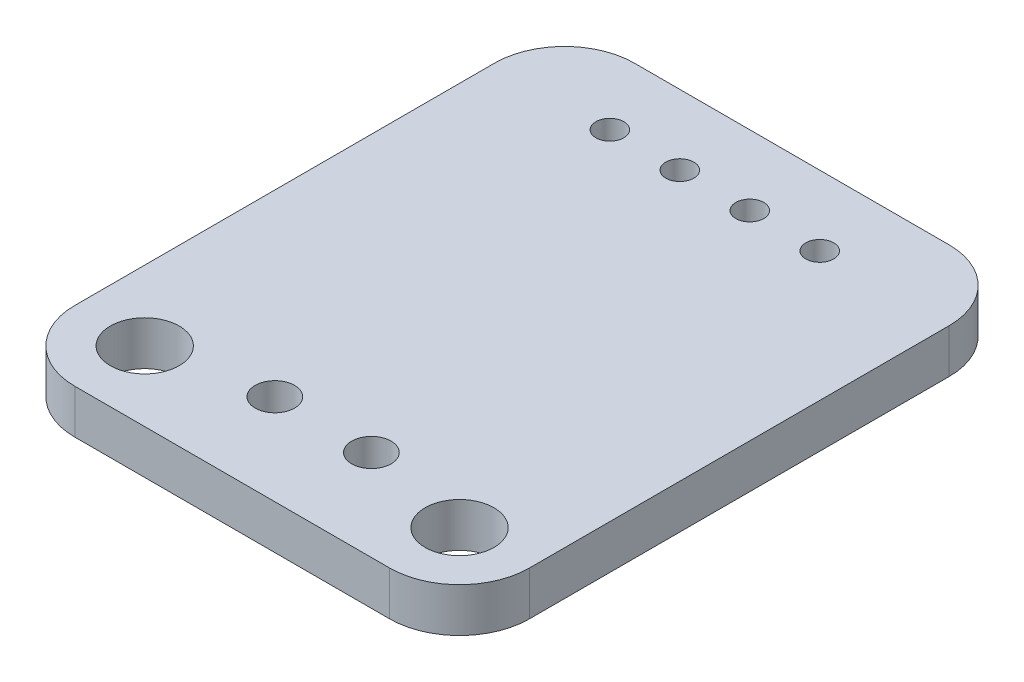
ISO-10303-21;
HEADER;
FILE_DESCRIPTION(('STEP AP214'),'2;1');
FILE_NAME('part.step','',(''),(''),'','','');
FILE_SCHEMA(('AUTOMOTIVE_DESIGN { 1 0 10303 214 1 1 1 1 }'));
ENDSEC;
DATA;
#1=APPLICATION_CONTEXT('core data for automotive mechanical design processes');
#2=APPLICATION_PROTOCOL_DEFINITION('international standard','automotive_design',2000,#1);
#3=PRODUCT_CONTEXT('',#1,'mechanical');
#4=PRODUCT('Part','Part','',(#3));
#5=PRODUCT_RELATED_PRODUCT_CATEGORY('part','',(#4));
#6=PRODUCT_DEFINITION_FORMATION('','',#4);
#7=PRODUCT_DEFINITION_CONTEXT('part definition',#1,'design');
#8=PRODUCT_DEFINITION('design','',#6,#7);
#9=PRODUCT_DEFINITION_SHAPE('','',#8);
#10=(LENGTH_UNIT() NAMED_UNIT(*) SI_UNIT(.MILLI.,.METRE.));
#11=(NAMED_UNIT(*) PLANE_ANGLE_UNIT() SI_UNIT($,.RADIAN.));
#12=(NAMED_UNIT(*) SI_UNIT($,.STERADIAN.) SOLID_ANGLE_UNIT());
#13=UNCERTAINTY_MEASURE_WITH_UNIT(LENGTH_MEASURE(1.E-05),#10,'distance_accuracy_value','');
#14=(GEOMETRIC_REPRESENTATION_CONTEXT(3) GLOBAL_UNCERTAINTY_ASSIGNED_CONTEXT((#13)) GLOBAL_UNIT_ASSIGNED_CONTEXT((#10,
#11,#12)) REPRESENTATION_CONTEXT('',''));
#15=CARTESIAN_POINT('',(0.,0.,0.));
#16=DIRECTION('',(0.,0.,1.));
#17=DIRECTION('',(1.,0.,0.));
#18=AXIS2_PLACEMENT_3D('',#15,#16,#17);
#19=CARTESIAN_POINT('',(-8.255,1.6002,-10.16));
#20=DIRECTION('',(1.,0.,0.));
#21=DIRECTION('',(0.,0.,-1.));
#22=AXIS2_PLACEMENT_3D('',#19,#20,#21);
#23=PLANE('',#22);
#24=DIRECTION('',(0.,0.,1.));
#25=VECTOR('',#24,1.);
#26=CARTESIAN_POINT('',(-8.255,1.6002,-10.16));
#27=LINE('',#26,#25);
#28=CARTESIAN_POINT('',(-8.255,1.6002,-7.62));
#29=VERTEX_POINT('',#28);
#30=CARTESIAN_POINT('',(-8.255,1.6002,7.62));
#31=VERTEX_POINT('',#30);
#32=EDGE_CURVE('E133',#29,#31,#27,.T.);
#33=ORIENTED_EDGE('',*,*,#32,.F.);
#34=DIRECTION('',(0.,-1.,0.));
#35=VECTOR('',#34,1.);
#36=CARTESIAN_POINT('',(-8.255,1.6002,-7.62));
#37=LINE('',#36,#35);
#38=CARTESIAN_POINT('',(-8.255,0.,-7.62));
#39=VERTEX_POINT('',#38);
#40=EDGE_CURVE('E117',#29,#39,#37,.T.);
#41=ORIENTED_EDGE('',*,*,#40,.T.);
#42=DIRECTION('',(0.,0.,1.));
#43=VECTOR('',#42,1.);
#44=CARTESIAN_POINT('',(-8.255,0.,-10.16));
#45=LINE('',#44,#43);
#46=CARTESIAN_POINT('',(-8.255,0.,7.62));
#47=VERTEX_POINT('',#46);
#48=EDGE_CURVE('E130',#39,#47,#45,.T.);
#49=ORIENTED_EDGE('',*,*,#48,.T.);
#50=DIRECTION('',(0.,-1.,0.));
#51=VECTOR('',#50,1.);
#52=CARTESIAN_POINT('',(-8.255,1.6002,7.62));
#53=LINE('',#52,#51);
#54=EDGE_CURVE('E136',#47,#31,#53,.F.);
#55=ORIENTED_EDGE('',*,*,#54,.T.);
#56=EDGE_LOOP('',(#33,#41,#49,#55));
#57=FACE_BOUND('',#56,.T.);
#58=ADVANCED_FACE('F39',(#57),#23,.F.);
#59=CARTESIAN_POINT('',(-8.255,1.6002,10.16));
#60=DIRECTION('',(0.,0.,-1.));
#61=DIRECTION('',(-1.,0.,0.));
#62=AXIS2_PLACEMENT_3D('',#59,#60,#61);
#63=PLANE('',#62);
#64=DIRECTION('',(1.,0.,0.));
#65=VECTOR('',#64,1.);
#66=CARTESIAN_POINT('',(-8.255,0.,10.16));
#67=LINE('',#66,#65);
#68=CARTESIAN_POINT('',(-5.715,0.,10.16));
#69=VERTEX_POINT('',#68);
#70=CARTESIAN_POINT('',(5.715,0.,10.16));
#71=VERTEX_POINT('',#70);
#72=EDGE_CURVE('E141',#69,#71,#67,.T.);
#73=ORIENTED_EDGE('',*,*,#72,.T.);
#74=DIRECTION('',(0.,-1.,0.));
#75=VECTOR('',#74,1.);
#76=CARTESIAN_POINT('',(5.715,1.6002,10.16));
#77=LINE('',#76,#75);
#78=CARTESIAN_POINT('',(5.715,1.6002,10.16));
#79=VERTEX_POINT('',#78);
#80=EDGE_CURVE('E11',#71,#79,#77,.F.);
#81=ORIENTED_EDGE('',*,*,#80,.T.);
#82=DIRECTION('',(1.,0.,0.));
#83=VECTOR('',#82,1.);
#84=CARTESIAN_POINT('',(-8.255,1.6002,10.16));
#85=LINE('',#84,#83);
#86=CARTESIAN_POINT('',(-5.715,1.6002,10.16));
#87=VERTEX_POINT('',#86);
#88=EDGE_CURVE('E191',#87,#79,#85,.T.);
#89=ORIENTED_EDGE('',*,*,#88,.F.);
#90=DIRECTION('',(0.,-1.,0.));
#91=VECTOR('',#90,1.);
#92=CARTESIAN_POINT('',(-5.715,1.6002,10.16));
#93=LINE('',#92,#91);
#94=EDGE_CURVE('E48',#87,#69,#93,.T.);
#95=ORIENTED_EDGE('',*,*,#94,.T.);
#96=EDGE_LOOP('',(#73,#81,#89,#95));
#97=FACE_BOUND('',#96,.T.);
#98=ADVANCED_FACE('F189',(#97),#63,.F.);
#99=CARTESIAN_POINT('',(8.255,1.6002,-10.16));
#100=DIRECTION('',(-1.,0.,0.));
#101=DIRECTION('',(0.,0.,1.));
#102=AXIS2_PLACEMENT_3D('',#99,#100,#101);
#103=PLANE('',#102);
#104=DIRECTION('',(0.,0.,-1.));
#105=VECTOR('',#104,1.);
#106=CARTESIAN_POINT('',(8.255,0.,-10.16));
#107=LINE('',#106,#105);
#108=CARTESIAN_POINT('',(8.255,0.,7.62));
#109=VERTEX_POINT('',#108);
#110=CARTESIAN_POINT('',(8.255,0.,-7.62));
#111=VERTEX_POINT('',#110);
#112=EDGE_CURVE('E148',#109,#111,#107,.T.);
#113=ORIENTED_EDGE('',*,*,#112,.T.);
#114=DIRECTION('',(0.,-1.,0.));
#115=VECTOR('',#114,1.);
#116=CARTESIAN_POINT('',(8.255,1.6002,-7.62));
#117=LINE('',#116,#115);
#118=CARTESIAN_POINT('',(8.255,1.6002,-7.62));
#119=VERTEX_POINT('',#118);
#120=EDGE_CURVE('E55',#111,#119,#117,.F.);
#121=ORIENTED_EDGE('',*,*,#120,.T.);
#122=DIRECTION('',(0.,0.,-1.));
#123=VECTOR('',#122,1.);
#124=CARTESIAN_POINT('',(8.255,1.6002,-10.16));
#125=LINE('',#124,#123);
#126=CARTESIAN_POINT('',(8.255,1.6002,7.62));
#127=VERTEX_POINT('',#126);
#128=EDGE_CURVE('E199',#127,#119,#125,.T.);
#129=ORIENTED_EDGE('',*,*,#128,.F.);
#130=DIRECTION('',(0.,-1.,0.));
#131=VECTOR('',#130,1.);
#132=CARTESIAN_POINT('',(8.255,1.6002,7.62));
#133=LINE('',#132,#131);
#134=EDGE_CURVE('E182',#127,#109,#133,.T.);
#135=ORIENTED_EDGE('',*,*,#134,.T.);
#136=EDGE_LOOP('',(#113,#121,#129,#135));
#137=FACE_BOUND('',#136,.T.);
#138=ADVANCED_FACE('F198',(#137),#103,.F.);
#139=CARTESIAN_POINT('',(-8.255,1.6002,-10.16));
#140=DIRECTION('',(0.,0.,1.));
#141=DIRECTION('',(1.,0.,0.));
#142=AXIS2_PLACEMENT_3D('',#139,#140,#141);
#143=PLANE('',#142);
#144=DIRECTION('',(-1.,0.,0.));
#145=VECTOR('',#144,1.);
#146=CARTESIAN_POINT('',(-8.255,0.,-10.16));
#147=LINE('',#146,#145);
#148=CARTESIAN_POINT('',(5.715,0.,-10.16));
#149=VERTEX_POINT('',#148);
#150=CARTESIAN_POINT('',(-5.715,0.,-10.16));
#151=VERTEX_POINT('',#150);
#152=EDGE_CURVE('E158',#149,#151,#147,.T.);
#153=ORIENTED_EDGE('',*,*,#152,.T.);
#154=DIRECTION('',(0.,-1.,0.));
#155=VECTOR('',#154,1.);
#156=CARTESIAN_POINT('',(-5.715,1.6002,-10.16));
#157=LINE('',#156,#155);
#158=CARTESIAN_POINT('',(-5.715,1.6002,-10.16));
#159=VERTEX_POINT('',#158);
#160=EDGE_CURVE('E118',#151,#159,#157,.F.);
#161=ORIENTED_EDGE('',*,*,#160,.T.);
#162=DIRECTION('',(-1.,0.,0.));
#163=VECTOR('',#162,1.);
#164=CARTESIAN_POINT('',(-8.255,1.6002,-10.16));
#165=LINE('',#164,#163);
#166=CARTESIAN_POINT('',(5.715,1.6002,-10.16));
#167=VERTEX_POINT('',#166);
#168=EDGE_CURVE('E154',#167,#159,#165,.T.);
#169=ORIENTED_EDGE('',*,*,#168,.F.);
#170=DIRECTION('',(0.,-1.,0.));
#171=VECTOR('',#170,1.);
#172=CARTESIAN_POINT('',(5.715,1.6002,-10.16));
#173=LINE('',#172,#171);
#174=EDGE_CURVE('E124',#167,#149,#173,.T.);
#175=ORIENTED_EDGE('',*,*,#174,.T.);
#176=EDGE_LOOP('',(#153,#161,#169,#175));
#177=FACE_BOUND('',#176,.T.);
#178=ADVANCED_FACE('F267',(#177),#143,.F.);
#179=CARTESIAN_POINT('',(0.,1.6002,0.));
#180=DIRECTION('',(0.,1.,0.));
#181=DIRECTION('',(0.,0.,1.));
#182=AXIS2_PLACEMENT_3D('',#179,#180,#181);
#183=PLANE('',#182);
#184=CARTESIAN_POINT('',(1.75260000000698,1.6002,6.858));
#185=DIRECTION('',(0.,1.,0.));
#186=DIRECTION('',(0.,0.,-1.));
#187=AXIS2_PLACEMENT_3D('',#184,#185,#186);
#188=CIRCLE('',#187,0.716091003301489);
#189=CARTESIAN_POINT('',(1.75260000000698,1.6002,7.57409100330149));
#190=VERTEX_POINT('',#189);
#191=EDGE_CURVE('E257',#190,#190,#188,.T.);
#192=ORIENTED_EDGE('',*,*,#191,.F.);
#193=EDGE_LOOP('',(#192));
#194=FACE_BOUND('',#193,.T.);
#195=CARTESIAN_POINT('',(-1.7526,1.6002,6.858));
#196=DIRECTION('',(0.,1.,0.));
#197=DIRECTION('',(0.,0.,1.));
#198=AXIS2_PLACEMENT_3D('',#195,#196,#197);
#199=CIRCLE('',#198,0.716091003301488);
#200=CARTESIAN_POINT('',(-1.7526,1.6002,7.57409100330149));
#201=VERTEX_POINT('',#200);
#202=EDGE_CURVE('E251',#201,#201,#199,.T.);
#203=ORIENTED_EDGE('',*,*,#202,.F.);
#204=EDGE_LOOP('',(#203));
#205=FACE_BOUND('',#204,.T.);
#206=CARTESIAN_POINT('',(3.55398097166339,1.6002,-7.61999999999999));
#207=DIRECTION('',(0.,1.,0.));
#208=DIRECTION('',(0.,0.,1.));
#209=AXIS2_PLACEMENT_3D('',#206,#207,#208);
#210=CIRCLE('',#209,0.508000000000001);
#211=CARTESIAN_POINT('',(3.55398097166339,1.6002,-7.11199999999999));
#212=VERTEX_POINT('',#211);
#213=EDGE_CURVE('E245',#212,#212,#210,.T.);
#214=ORIENTED_EDGE('',*,*,#213,.F.);
#215=EDGE_LOOP('',(#214));
#216=FACE_BOUND('',#215,.T.);
#217=CARTESIAN_POINT('',(1.01398097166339,1.6002,-7.61999999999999));
#218=DIRECTION('',(0.,1.,0.));
#219=DIRECTION('',(0.,0.,1.));
#220=AXIS2_PLACEMENT_3D('',#217,#218,#219);
#221=CIRCLE('',#220,0.508);
#222=CARTESIAN_POINT('',(1.01398097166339,1.6002,-7.11199999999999));
#223=VERTEX_POINT('',#222);
#224=EDGE_CURVE('E238',#223,#223,#221,.T.);
#225=ORIENTED_EDGE('',*,*,#224,.F.);
#226=EDGE_LOOP('',(#225));
#227=FACE_BOUND('',#226,.T.);
#228=CARTESIAN_POINT('',(-1.52601902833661,1.6002,-7.61999999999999));
#229=DIRECTION('',(0.,1.,0.));
#230=DIRECTION('',(0.,0.,1.));
#231=AXIS2_PLACEMENT_3D('',#228,#229,#230);
#232=CIRCLE('',#231,0.508);
#233=CARTESIAN_POINT('',(-1.52601902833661,1.6002,-7.11199999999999));
#234=VERTEX_POINT('',#233);
#235=EDGE_CURVE('E230',#234,#234,#232,.T.);
#236=ORIENTED_EDGE('',*,*,#235,.F.);
#237=EDGE_LOOP('',(#236));
#238=FACE_BOUND('',#237,.T.);
#239=CARTESIAN_POINT('',(-4.06601902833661,1.6002,-7.61999999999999));
#240=DIRECTION('',(0.,1.,0.));
#241=DIRECTION('',(0.,0.,1.));
#242=AXIS2_PLACEMENT_3D('',#239,#240,#241);
#243=CIRCLE('',#242,0.508);
#244=CARTESIAN_POINT('',(-4.06601902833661,1.6002,-7.11199999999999));
#245=VERTEX_POINT('',#244);
#246=EDGE_CURVE('E222',#245,#245,#243,.T.);
#247=ORIENTED_EDGE('',*,*,#246,.F.);
#248=EDGE_LOOP('',(#247));
#249=FACE_BOUND('',#248,.T.);
#250=CARTESIAN_POINT('',(5.715,1.6002,7.62));
#251=DIRECTION('',(0.,1.,0.));
#252=DIRECTION('',(0.,0.,1.));
#253=AXIS2_PLACEMENT_3D('',#250,#251,#252);
#254=CIRCLE('',#253,1.25);
#255=CARTESIAN_POINT('',(5.715,1.6002,8.87));
#256=VERTEX_POINT('',#255);
#257=EDGE_CURVE('E214',#256,#256,#254,.T.);
#258=ORIENTED_EDGE('',*,*,#257,.F.);
#259=EDGE_LOOP('',(#258));
#260=FACE_BOUND('',#259,.T.);
#261=CARTESIAN_POINT('',(-5.715,1.6002,7.62));
#262=DIRECTION('',(0.,1.,0.));
#263=DIRECTION('',(0.,0.,1.));
#264=AXIS2_PLACEMENT_3D('',#261,#262,#263);
#265=CIRCLE('',#264,1.25);
#266=CARTESIAN_POINT('',(-5.715,1.6002,8.87));
#267=VERTEX_POINT('',#266);
#268=EDGE_CURVE('E151',#267,#267,#265,.T.);
#269=ORIENTED_EDGE('',*,*,#268,.F.);
#270=EDGE_LOOP('',(#269));
#271=FACE_BOUND('',#270,.T.);
#272=ORIENTED_EDGE('',*,*,#168,.T.);
#273=CARTESIAN_POINT('',(-5.715,1.6002,-7.62));
#274=DIRECTION('',(0.,1.,0.));
#275=DIRECTION('',(0.,0.,1.));
#276=AXIS2_PLACEMENT_3D('',#273,#274,#275);
#277=CIRCLE('',#276,2.54);
#278=EDGE_CURVE('E179',#159,#29,#277,.T.);
#279=ORIENTED_EDGE('',*,*,#278,.T.);
#280=ORIENTED_EDGE('',*,*,#32,.T.);
#281=CARTESIAN_POINT('',(-5.715,1.6002,7.62));
#282=DIRECTION('',(0.,1.,0.));
#283=DIRECTION('',(0.,0.,1.));
#284=AXIS2_PLACEMENT_3D('',#281,#282,#283);
#285=CIRCLE('',#284,2.54);
#286=EDGE_CURVE('E172',#31,#87,#285,.T.);
#287=ORIENTED_EDGE('',*,*,#286,.T.);
#288=ORIENTED_EDGE('',*,*,#88,.T.);
#289=CARTESIAN_POINT('',(5.715,1.6002,7.62));
#290=DIRECTION('',(0.,1.,0.));
#291=DIRECTION('',(0.,0.,1.));
#292=AXIS2_PLACEMENT_3D('',#289,#290,#291);
#293=CIRCLE('',#292,2.54);
#294=EDGE_CURVE('E62',#79,#127,#293,.T.);
#295=ORIENTED_EDGE('',*,*,#294,.T.);
#296=ORIENTED_EDGE('',*,*,#128,.T.);
#297=CARTESIAN_POINT('',(5.715,1.6002,-7.62));
#298=DIRECTION('',(0.,1.,0.));
#299=DIRECTION('',(0.,0.,1.));
#300=AXIS2_PLACEMENT_3D('',#297,#298,#299);
#301=CIRCLE('',#300,2.54);
#302=EDGE_CURVE('E176',#119,#167,#301,.T.);
#303=ORIENTED_EDGE('',*,*,#302,.T.);
#304=EDGE_LOOP('',(#272,#279,#280,#287,#288,#295,#296,#303));
#305=FACE_BOUND('',#304,.T.);
#306=ADVANCED_FACE('F264',(#194,#205,#216,#227,#238,#249,#260,#271,#305),#183,.T.);
#307=CARTESIAN_POINT('',(0.,0.,0.));
#308=DIRECTION('',(0.,1.,0.));
#309=DIRECTION('',(0.,0.,1.));
#310=AXIS2_PLACEMENT_3D('',#307,#308,#309);
#311=PLANE('',#310);
#312=CARTESIAN_POINT('',(1.75260000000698,0.,6.858));
#313=DIRECTION('',(0.,1.,0.));
#314=DIRECTION('',(0.,0.,1.));
#315=AXIS2_PLACEMENT_3D('',#312,#313,#314);
#316=CIRCLE('',#315,0.716091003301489);
#317=CARTESIAN_POINT('',(1.75260000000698,0.,7.57409100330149));
#318=VERTEX_POINT('',#317);
#319=EDGE_CURVE('E254',#318,#318,#316,.F.);
#320=ORIENTED_EDGE('',*,*,#319,.F.);
#321=EDGE_LOOP('',(#320));
#322=FACE_BOUND('',#321,.T.);
#323=CARTESIAN_POINT('',(-1.7526,0.,6.858));
#324=DIRECTION('',(0.,1.,0.));
#325=DIRECTION('',(0.,0.,1.));
#326=AXIS2_PLACEMENT_3D('',#323,#324,#325);
#327=CIRCLE('',#326,0.716091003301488);
#328=CARTESIAN_POINT('',(-1.7526,0.,7.57409100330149));
#329=VERTEX_POINT('',#328);
#330=EDGE_CURVE('E248',#329,#329,#327,.F.);
#331=ORIENTED_EDGE('',*,*,#330,.F.);
#332=EDGE_LOOP('',(#331));
#333=FACE_BOUND('',#332,.T.);
#334=CARTESIAN_POINT('',(3.55398097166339,0.,-7.61999999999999));
#335=DIRECTION('',(0.,1.,0.));
#336=DIRECTION('',(0.,0.,1.));
#337=AXIS2_PLACEMENT_3D('',#334,#335,#336);
#338=CIRCLE('',#337,0.508000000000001);
#339=CARTESIAN_POINT('',(3.55398097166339,0.,-7.11199999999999));
#340=VERTEX_POINT('',#339);
#341=EDGE_CURVE('E241',#340,#340,#338,.F.);
#342=ORIENTED_EDGE('',*,*,#341,.F.);
#343=EDGE_LOOP('',(#342));
#344=FACE_BOUND('',#343,.T.);
#345=CARTESIAN_POINT('',(1.01398097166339,0.,-7.61999999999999));
#346=DIRECTION('',(0.,1.,0.));
#347=DIRECTION('',(0.,0.,1.));
#348=AXIS2_PLACEMENT_3D('',#345,#346,#347);
#349=CIRCLE('',#348,0.508);
#350=CARTESIAN_POINT('',(1.01398097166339,0.,-7.11199999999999));
#351=VERTEX_POINT('',#350);
#352=EDGE_CURVE('E234',#351,#351,#349,.F.);
#353=ORIENTED_EDGE('',*,*,#352,.F.);
#354=EDGE_LOOP('',(#353));
#355=FACE_BOUND('',#354,.T.);
#356=CARTESIAN_POINT('',(-1.52601902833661,0.,-7.61999999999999));
#357=DIRECTION('',(0.,1.,0.));
#358=DIRECTION('',(0.,0.,1.));
#359=AXIS2_PLACEMENT_3D('',#356,#357,#358);
#360=CIRCLE('',#359,0.508);
#361=CARTESIAN_POINT('',(-1.52601902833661,0.,-7.11199999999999));
#362=VERTEX_POINT('',#361);
#363=EDGE_CURVE('E226',#362,#362,#360,.F.);
#364=ORIENTED_EDGE('',*,*,#363,.F.);
#365=EDGE_LOOP('',(#364));
#366=FACE_BOUND('',#365,.T.);
#367=CARTESIAN_POINT('',(-4.06601902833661,0.,-7.61999999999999));
#368=DIRECTION('',(0.,1.,0.));
#369=DIRECTION('',(0.,0.,1.));
#370=AXIS2_PLACEMENT_3D('',#367,#368,#369);
#371=CIRCLE('',#370,0.508);
#372=CARTESIAN_POINT('',(-4.06601902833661,0.,-7.11199999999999));
#373=VERTEX_POINT('',#372);
#374=EDGE_CURVE('E218',#373,#373,#371,.F.);
#375=ORIENTED_EDGE('',*,*,#374,.F.);
#376=EDGE_LOOP('',(#375));
#377=FACE_BOUND('',#376,.T.);
#378=CARTESIAN_POINT('',(5.715,0.,7.62));
#379=DIRECTION('',(0.,1.,0.));
#380=DIRECTION('',(0.,0.,1.));
#381=AXIS2_PLACEMENT_3D('',#378,#379,#380);
#382=CIRCLE('',#381,1.25);
#383=CARTESIAN_POINT('',(5.715,0.,8.87));
#384=VERTEX_POINT('',#383);
#385=EDGE_CURVE('E210',#384,#384,#382,.F.);
#386=ORIENTED_EDGE('',*,*,#385,.F.);
#387=EDGE_LOOP('',(#386));
#388=FACE_BOUND('',#387,.T.);
#389=CARTESIAN_POINT('',(-5.715,0.,7.62));
#390=DIRECTION('',(0.,1.,0.));
#391=DIRECTION('',(0.,0.,1.));
#392=AXIS2_PLACEMENT_3D('',#389,#390,#391);
#393=CIRCLE('',#392,1.25);
#394=CARTESIAN_POINT('',(-5.715,0.,8.87));
#395=VERTEX_POINT('',#394);
#396=EDGE_CURVE('E142',#395,#395,#393,.F.);
#397=ORIENTED_EDGE('',*,*,#396,.F.);
#398=EDGE_LOOP('',(#397));
#399=FACE_BOUND('',#398,.T.);
#400=ORIENTED_EDGE('',*,*,#48,.F.);
#401=CARTESIAN_POINT('',(-5.715,0.,-7.62));
#402=DIRECTION('',(0.,1.,0.));
#403=DIRECTION('',(0.,0.,1.));
#404=AXIS2_PLACEMENT_3D('',#401,#402,#403);
#405=CIRCLE('',#404,2.54);
#406=EDGE_CURVE('E113',#39,#151,#405,.F.);
#407=ORIENTED_EDGE('',*,*,#406,.T.);
#408=ORIENTED_EDGE('',*,*,#152,.F.);
#409=CARTESIAN_POINT('',(5.715,0.,-7.62));
#410=DIRECTION('',(0.,1.,0.));
#411=DIRECTION('',(0.,0.,1.));
#412=AXIS2_PLACEMENT_3D('',#409,#410,#411);
#413=CIRCLE('',#412,2.54);
#414=EDGE_CURVE('E125',#149,#111,#413,.F.);
#415=ORIENTED_EDGE('',*,*,#414,.T.);
#416=ORIENTED_EDGE('',*,*,#112,.F.);
#417=CARTESIAN_POINT('',(5.715,0.,7.62));
#418=DIRECTION('',(0.,1.,0.));
#419=DIRECTION('',(0.,0.,1.));
#420=AXIS2_PLACEMENT_3D('',#417,#418,#419);
#421=CIRCLE('',#420,2.54);
#422=EDGE_CURVE('E163',#109,#71,#421,.F.);
#423=ORIENTED_EDGE('',*,*,#422,.T.);
#424=ORIENTED_EDGE('',*,*,#72,.F.);
#425=CARTESIAN_POINT('',(-5.715,0.,7.62));
#426=DIRECTION('',(0.,1.,0.));
#427=DIRECTION('',(0.,0.,1.));
#428=AXIS2_PLACEMENT_3D('',#425,#426,#427);
#429=CIRCLE('',#428,2.54);
#430=EDGE_CURVE('E135',#69,#47,#429,.F.);
#431=ORIENTED_EDGE('',*,*,#430,.T.);
#432=EDGE_LOOP('',(#400,#407,#408,#415,#416,#423,#424,#431));
#433=FACE_BOUND('',#432,.T.);
#434=ADVANCED_FACE('F138',(#322,#333,#344,#355,#366,#377,#388,#399,#433),#311,.F.);
#435=CARTESIAN_POINT('',(-5.715,-0.000999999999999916,7.62));
#436=DIRECTION('',(0.,1.,0.));
#437=DIRECTION('',(0.,0.,1.));
#438=AXIS2_PLACEMENT_3D('',#435,#436,#437);
#439=CYLINDRICAL_SURFACE('',#438,1.25);
#440=CARTESIAN_POINT('',(-5.715,1.6002,8.87));
#441=CARTESIAN_POINT('',(-5.715,1.58353125,8.87));
#442=CARTESIAN_POINT('',(-5.715,1.5668625,8.87));
#443=CARTESIAN_POINT('',(-5.715,1.533525,8.87));
#444=CARTESIAN_POINT('',(-5.715,1.51685625,8.87));
#445=CARTESIAN_POINT('',(-5.715,1.48351875,8.87));
#446=CARTESIAN_POINT('',(-5.715,1.46685,8.87));
#447=CARTESIAN_POINT('',(-5.715,1.4335125,8.87));
#448=CARTESIAN_POINT('',(-5.715,1.41684375,8.87));
#449=CARTESIAN_POINT('',(-5.715,1.38350625,8.87));
#450=CARTESIAN_POINT('',(-5.715,1.3668375,8.87));
#451=CARTESIAN_POINT('',(-5.715,1.3335,8.87));
#452=CARTESIAN_POINT('',(-5.715,1.31683125,8.87));
#453=CARTESIAN_POINT('',(-5.715,1.28349375,8.87));
#454=CARTESIAN_POINT('',(-5.715,1.266825,8.87));
#455=CARTESIAN_POINT('',(-5.715,1.2334875,8.87));
#456=CARTESIAN_POINT('',(-5.715,1.21681875,8.87));
#457=CARTESIAN_POINT('',(-5.715,1.18348125,8.87));
#458=CARTESIAN_POINT('',(-5.715,1.1668125,8.87));
#459=CARTESIAN_POINT('',(-5.715,1.133475,8.87));
#460=CARTESIAN_POINT('',(-5.715,1.11680625,8.87));
#461=CARTESIAN_POINT('',(-5.715,1.08346875,8.87));
#462=CARTESIAN_POINT('',(-5.715,1.0668,8.87));
#463=CARTESIAN_POINT('',(-5.715,1.0334625,8.87));
#464=CARTESIAN_POINT('',(-5.715,1.01679375,8.87));
#465=CARTESIAN_POINT('',(-5.715,0.98345625,8.87));
#466=CARTESIAN_POINT('',(-5.715,0.9667875,8.87));
#467=CARTESIAN_POINT('',(-5.715,0.93345,8.87));
#468=CARTESIAN_POINT('',(-5.715,0.91678125,8.87));
#469=CARTESIAN_POINT('',(-5.715,0.88344375,8.87));
#470=CARTESIAN_POINT('',(-5.715,0.866775,8.87));
#471=CARTESIAN_POINT('',(-5.715,0.8334375,8.87));
#472=CARTESIAN_POINT('',(-5.715,0.81676875,8.87));
#473=CARTESIAN_POINT('',(-5.715,0.78343125,8.87));
#474=CARTESIAN_POINT('',(-5.715,0.7667625,8.87));
#475=CARTESIAN_POINT('',(-5.715,0.733425,8.87));
#476=CARTESIAN_POINT('',(-5.715,0.71675625,8.87));
#477=CARTESIAN_POINT('',(-5.715,0.68341875,8.87));
#478=CARTESIAN_POINT('',(-5.715,0.66675,8.87));
#479=CARTESIAN_POINT('',(-5.715,0.6334125,8.87));
#480=CARTESIAN_POINT('',(-5.715,0.61674375,8.87));
#481=CARTESIAN_POINT('',(-5.715,0.58340625,8.87));
#482=CARTESIAN_POINT('',(-5.715,0.5667375,8.87));
#483=CARTESIAN_POINT('',(-5.715,0.5334,8.87));
#484=CARTESIAN_POINT('',(-5.715,0.51673125,8.87));
#485=CARTESIAN_POINT('',(-5.715,0.48339375,8.87));
#486=CARTESIAN_POINT('',(-5.715,0.466725,8.87));
#487=CARTESIAN_POINT('',(-5.715,0.4333875,8.87));
#488=CARTESIAN_POINT('',(-5.715,0.41671875,8.87));
#489=CARTESIAN_POINT('',(-5.715,0.38338125,8.87));
#490=CARTESIAN_POINT('',(-5.715,0.3667125,8.87));
#491=CARTESIAN_POINT('',(-5.715,0.333375,8.87));
#492=CARTESIAN_POINT('',(-5.715,0.31670625,8.87));
#493=CARTESIAN_POINT('',(-5.715,0.28336875,8.87));
#494=CARTESIAN_POINT('',(-5.715,0.2667,8.87));
#495=CARTESIAN_POINT('',(-5.715,0.2333625,8.87));
#496=CARTESIAN_POINT('',(-5.715,0.21669375,8.87));
#497=CARTESIAN_POINT('',(-5.715,0.18335625,8.87));
#498=CARTESIAN_POINT('',(-5.715,0.1666875,8.87));
#499=CARTESIAN_POINT('',(-5.715,0.13335,8.87));
#500=CARTESIAN_POINT('',(-5.715,0.11668125,8.87));
#501=CARTESIAN_POINT('',(-5.715,0.08334375,8.87));
#502=CARTESIAN_POINT('',(-5.715,0.066675,8.87));
#503=CARTESIAN_POINT('',(-5.715,0.0333375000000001,8.87));
#504=CARTESIAN_POINT('',(-5.715,0.01666875,8.87));
#505=CARTESIAN_POINT('',(-5.715,0.,8.87));
#506=B_SPLINE_CURVE_WITH_KNOTS('',3,(#440,#441,#442,#443,#444,#445,#446,#447,#448,#449,#450,
#451,#452,#453,#454,#455,#456,#457,#458,#459,#460,#461,#462,#463,#464,#465,#466,#467,#468,#469,
#470,#471,#472,#473,#474,#475,#476,#477,#478,#479,#480,#481,#482,#483,#484,#485,#486,#487,#488,
#489,#490,#491,#492,#493,#494,#495,#496,#497,#498,#499,#500,#501,#502,#503,#504,#505),
.UNSPECIFIED.,.F.,.F.,(4,2,2,2,2,2,2,2,2,2,2,2,2,2,2,2,2,2,2,2,2,2,2,2,2,2,2,2,2,2,2,2,4),(0.,
0.0500062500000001,0.1000125,0.15001875,0.200025,0.25003125,0.3000375,0.35004375,0.40005,
0.45005625,0.5000625,0.55006875,0.600075,0.65008125,0.7000875,0.75009375,0.8001,0.85010625,
0.9001125,0.95011875,1.000125,1.05013125,1.1001375,1.15014375,1.20015,1.25015625,1.3001625,
1.35016875,1.400175,1.45018125,1.5001875,1.55019375,1.6002),.UNSPECIFIED.);
#507=EDGE_CURVE('BSEAM307',#267,#395,#506,.T.);
#508=ORIENTED_EDGE('',*,*,#268,.T.);
#509=ORIENTED_EDGE('',*,*,#396,.T.);
#510=ORIENTED_EDGE('',*,*,#507,.T.);
#511=ORIENTED_EDGE('',*,*,#507,.F.);
#512=EDGE_LOOP('',(#508,#510,#509,#511));
#513=FACE_BOUND('',#512,.T.);
#514=ADVANCED_FACE('F307',(#513),#439,.F.);
#515=CARTESIAN_POINT('',(5.715,-0.000999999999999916,7.62));
#516=DIRECTION('',(0.,1.,0.));
#517=DIRECTION('',(0.,0.,1.));
#518=AXIS2_PLACEMENT_3D('',#515,#516,#517);
#519=CYLINDRICAL_SURFACE('',#518,1.25);
#520=CARTESIAN_POINT('',(5.715,1.6002,8.87));
#521=CARTESIAN_POINT('',(5.715,1.58353125,8.87));
#522=CARTESIAN_POINT('',(5.715,1.5668625,8.87));
#523=CARTESIAN_POINT('',(5.715,1.533525,8.87));
#524=CARTESIAN_POINT('',(5.715,1.51685625,8.87));
#525=CARTESIAN_POINT('',(5.715,1.48351875,8.87));
#526=CARTESIAN_POINT('',(5.715,1.46685,8.87));
#527=CARTESIAN_POINT('',(5.715,1.4335125,8.87));
#528=CARTESIAN_POINT('',(5.715,1.41684375,8.87));
#529=CARTESIAN_POINT('',(5.715,1.38350625,8.87));
#530=CARTESIAN_POINT('',(5.715,1.3668375,8.87));
#531=CARTESIAN_POINT('',(5.715,1.3335,8.87));
#532=CARTESIAN_POINT('',(5.715,1.31683125,8.87));
#533=CARTESIAN_POINT('',(5.715,1.28349375,8.87));
#534=CARTESIAN_POINT('',(5.715,1.266825,8.87));
#535=CARTESIAN_POINT('',(5.715,1.2334875,8.87));
#536=CARTESIAN_POINT('',(5.715,1.21681875,8.87));
#537=CARTESIAN_POINT('',(5.715,1.18348125,8.87));
#538=CARTESIAN_POINT('',(5.715,1.1668125,8.87));
#539=CARTESIAN_POINT('',(5.715,1.133475,8.87));
#540=CARTESIAN_POINT('',(5.715,1.11680625,8.87));
#541=CARTESIAN_POINT('',(5.715,1.08346875,8.87));
#542=CARTESIAN_POINT('',(5.715,1.0668,8.87));
#543=CARTESIAN_POINT('',(5.715,1.0334625,8.87));
#544=CARTESIAN_POINT('',(5.715,1.01679375,8.87));
#545=CARTESIAN_POINT('',(5.715,0.98345625,8.87));
#546=CARTESIAN_POINT('',(5.715,0.9667875,8.87));
#547=CARTESIAN_POINT('',(5.715,0.93345,8.87));
#548=CARTESIAN_POINT('',(5.715,0.91678125,8.87));
#549=CARTESIAN_POINT('',(5.715,0.88344375,8.87));
#550=CARTESIAN_POINT('',(5.715,0.866775,8.87));
#551=CARTESIAN_POINT('',(5.715,0.8334375,8.87));
#552=CARTESIAN_POINT('',(5.715,0.81676875,8.87));
#553=CARTESIAN_POINT('',(5.715,0.78343125,8.87));
#554=CARTESIAN_POINT('',(5.715,0.7667625,8.87));
#555=CARTESIAN_POINT('',(5.715,0.733425,8.87));
#556=CARTESIAN_POINT('',(5.715,0.71675625,8.87));
#557=CARTESIAN_POINT('',(5.715,0.68341875,8.87));
#558=CARTESIAN_POINT('',(5.715,0.66675,8.87));
#559=CARTESIAN_POINT('',(5.715,0.6334125,8.87));
#560=CARTESIAN_POINT('',(5.715,0.61674375,8.87));
#561=CARTESIAN_POINT('',(5.715,0.58340625,8.87));
#562=CARTESIAN_POINT('',(5.715,0.5667375,8.87));
#563=CARTESIAN_POINT('',(5.715,0.5334,8.87));
#564=CARTESIAN_POINT('',(5.715,0.51673125,8.87));
#565=CARTESIAN_POINT('',(5.715,0.48339375,8.87));
#566=CARTESIAN_POINT('',(5.715,0.466725,8.87));
#567=CARTESIAN_POINT('',(5.715,0.4333875,8.87));
#568=CARTESIAN_POINT('',(5.715,0.41671875,8.87));
#569=CARTESIAN_POINT('',(5.715,0.38338125,8.87));
#570=CARTESIAN_POINT('',(5.715,0.3667125,8.87));
#571=CARTESIAN_POINT('',(5.715,0.333375,8.87));
#572=CARTESIAN_POINT('',(5.715,0.31670625,8.87));
#573=CARTESIAN_POINT('',(5.715,0.28336875,8.87));
#574=CARTESIAN_POINT('',(5.715,0.2667,8.87));
#575=CARTESIAN_POINT('',(5.715,0.2333625,8.87));
#576=CARTESIAN_POINT('',(5.715,0.21669375,8.87));
#577=CARTESIAN_POINT('',(5.715,0.18335625,8.87));
#578=CARTESIAN_POINT('',(5.715,0.1666875,8.87));
#579=CARTESIAN_POINT('',(5.715,0.13335,8.87));
#580=CARTESIAN_POINT('',(5.715,0.11668125,8.87));
#581=CARTESIAN_POINT('',(5.715,0.08334375,8.87));
#582=CARTESIAN_POINT('',(5.715,0.066675,8.87));
#583=CARTESIAN_POINT('',(5.715,0.0333375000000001,8.87));
#584=CARTESIAN_POINT('',(5.715,0.01666875,8.87));
#585=CARTESIAN_POINT('',(5.715,0.,8.87));
#586=B_SPLINE_CURVE_WITH_KNOTS('',3,(#520,#521,#522,#523,#524,#525,#526,#527,#528,#529,#530,
#531,#532,#533,#534,#535,#536,#537,#538,#539,#540,#541,#542,#543,#544,#545,#546,#547,#548,#549,
#550,#551,#552,#553,#554,#555,#556,#557,#558,#559,#560,#561,#562,#563,#564,#565,#566,#567,#568,
#569,#570,#571,#572,#573,#574,#575,#576,#577,#578,#579,#580,#581,#582,#583,#584,#585),
.UNSPECIFIED.,.F.,.F.,(4,2,2,2,2,2,2,2,2,2,2,2,2,2,2,2,2,2,2,2,2,2,2,2,2,2,2,2,2,2,2,2,4),(0.,
0.0500062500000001,0.1000125,0.15001875,0.200025,0.25003125,0.3000375,0.35004375,0.40005,
0.45005625,0.5000625,0.55006875,0.600075,0.65008125,0.7000875,0.75009375,0.8001,0.85010625,
0.9001125,0.95011875,1.000125,1.05013125,1.1001375,1.15014375,1.20015,1.25015625,1.3001625,
1.35016875,1.400175,1.45018125,1.5001875,1.55019375,1.6002),.UNSPECIFIED.);
#587=EDGE_CURVE('BSEAM312',#256,#384,#586,.T.);
#588=ORIENTED_EDGE('',*,*,#257,.T.);
#589=ORIENTED_EDGE('',*,*,#385,.T.);
#590=ORIENTED_EDGE('',*,*,#587,.T.);
#591=ORIENTED_EDGE('',*,*,#587,.F.);
#592=EDGE_LOOP('',(#588,#590,#589,#591));
#593=FACE_BOUND('',#592,.T.);
#594=ADVANCED_FACE('F312',(#593),#519,.F.);
#595=CARTESIAN_POINT('',(-4.06601902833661,-0.000999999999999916,-7.61999999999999));
#596=DIRECTION('',(0.,1.,0.));
#597=DIRECTION('',(0.,0.,1.));
#598=AXIS2_PLACEMENT_3D('',#595,#596,#597);
#599=CYLINDRICAL_SURFACE('',#598,0.508);
#600=ORIENTED_EDGE('',*,*,#246,.T.);
#601=EDGE_LOOP('',(#600));
#602=FACE_BOUND('',#601,.T.);
#603=ORIENTED_EDGE('',*,*,#374,.T.);
#604=EDGE_LOOP('',(#603));
#605=FACE_BOUND('',#604,.T.);
#606=ADVANCED_FACE('F316',(#602,#605),#599,.F.);
#607=CARTESIAN_POINT('',(-1.52601902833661,-0.000999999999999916,-7.61999999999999));
#608=DIRECTION('',(0.,1.,0.));
#609=DIRECTION('',(0.,0.,1.));
#610=AXIS2_PLACEMENT_3D('',#607,#608,#609);
#611=CYLINDRICAL_SURFACE('',#610,0.508);
#612=ORIENTED_EDGE('',*,*,#235,.T.);
#613=EDGE_LOOP('',(#612));
#614=FACE_BOUND('',#613,.T.);
#615=ORIENTED_EDGE('',*,*,#363,.T.);
#616=EDGE_LOOP('',(#615));
#617=FACE_BOUND('',#616,.T.);
#618=ADVANCED_FACE('F320',(#614,#617),#611,.F.);
#619=CARTESIAN_POINT('',(1.01398097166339,-0.000999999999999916,-7.61999999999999));
#620=DIRECTION('',(0.,1.,0.));
#621=DIRECTION('',(0.,0.,1.));
#622=AXIS2_PLACEMENT_3D('',#619,#620,#621);
#623=CYLINDRICAL_SURFACE('',#622,0.508);
#624=ORIENTED_EDGE('',*,*,#224,.T.);
#625=EDGE_LOOP('',(#624));
#626=FACE_BOUND('',#625,.T.);
#627=ORIENTED_EDGE('',*,*,#352,.T.);
#628=EDGE_LOOP('',(#627));
#629=FACE_BOUND('',#628,.T.);
#630=ADVANCED_FACE('F324',(#626,#629),#623,.F.);
#631=CARTESIAN_POINT('',(3.55398097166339,-0.000999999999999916,-7.61999999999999));
#632=DIRECTION('',(0.,1.,0.));
#633=DIRECTION('',(0.,0.,1.));
#634=AXIS2_PLACEMENT_3D('',#631,#632,#633);
#635=CYLINDRICAL_SURFACE('',#634,0.508000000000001);
#636=ORIENTED_EDGE('',*,*,#213,.T.);
#637=EDGE_LOOP('',(#636));
#638=FACE_BOUND('',#637,.T.);
#639=ORIENTED_EDGE('',*,*,#341,.T.);
#640=EDGE_LOOP('',(#639));
#641=FACE_BOUND('',#640,.T.);
#642=ADVANCED_FACE('F293',(#638,#641),#635,.F.);
#643=CARTESIAN_POINT('',(-5.715,1.6002,-7.62));
#644=DIRECTION('',(0.,-1.,0.));
#645=DIRECTION('',(0.,0.,-1.));
#646=AXIS2_PLACEMENT_3D('',#643,#644,#645);
#647=CYLINDRICAL_SURFACE('',#646,2.54);
#648=ORIENTED_EDGE('',*,*,#278,.F.);
#649=ORIENTED_EDGE('',*,*,#160,.F.);
#650=ORIENTED_EDGE('',*,*,#406,.F.);
#651=ORIENTED_EDGE('',*,*,#40,.F.);
#652=EDGE_LOOP('',(#648,#649,#650,#651));
#653=FACE_BOUND('',#652,.T.);
#654=ADVANCED_FACE('F116',(#653),#647,.T.);
#655=CARTESIAN_POINT('',(5.715,1.6002,-7.62));
#656=DIRECTION('',(0.,-1.,0.));
#657=DIRECTION('',(0.,0.,-1.));
#658=AXIS2_PLACEMENT_3D('',#655,#656,#657);
#659=CYLINDRICAL_SURFACE('',#658,2.54);
#660=ORIENTED_EDGE('',*,*,#302,.F.);
#661=ORIENTED_EDGE('',*,*,#120,.F.);
#662=ORIENTED_EDGE('',*,*,#414,.F.);
#663=ORIENTED_EDGE('',*,*,#174,.F.);
#664=EDGE_LOOP('',(#660,#661,#662,#663));
#665=FACE_BOUND('',#664,.T.);
#666=ADVANCED_FACE('F286',(#665),#659,.T.);
#667=CARTESIAN_POINT('',(5.715,1.6002,7.62));
#668=DIRECTION('',(0.,-1.,0.));
#669=DIRECTION('',(0.,0.,-1.));
#670=AXIS2_PLACEMENT_3D('',#667,#668,#669);
#671=CYLINDRICAL_SURFACE('',#670,2.54);
#672=ORIENTED_EDGE('',*,*,#294,.F.);
#673=ORIENTED_EDGE('',*,*,#80,.F.);
#674=ORIENTED_EDGE('',*,*,#422,.F.);
#675=ORIENTED_EDGE('',*,*,#134,.F.);
#676=EDGE_LOOP('',(#672,#673,#674,#675));
#677=FACE_BOUND('',#676,.T.);
#678=ADVANCED_FACE('F197',(#677),#671,.T.);
#679=CARTESIAN_POINT('',(-5.715,1.6002,7.62));
#680=DIRECTION('',(0.,-1.,0.));
#681=DIRECTION('',(0.,0.,-1.));
#682=AXIS2_PLACEMENT_3D('',#679,#680,#681);
#683=CYLINDRICAL_SURFACE('',#682,2.54);
#684=ORIENTED_EDGE('',*,*,#286,.F.);
#685=ORIENTED_EDGE('',*,*,#54,.F.);
#686=ORIENTED_EDGE('',*,*,#430,.F.);
#687=ORIENTED_EDGE('',*,*,#94,.F.);
#688=EDGE_LOOP('',(#684,#685,#686,#687));
#689=FACE_BOUND('',#688,.T.);
#690=ADVANCED_FACE('F41',(#689),#683,.T.);
#691=CARTESIAN_POINT('',(-1.7526,-0.000999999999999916,6.858));
#692=DIRECTION('',(0.,1.,0.));
#693=DIRECTION('',(0.,0.,1.));
#694=AXIS2_PLACEMENT_3D('',#691,#692,#693);
#695=CYLINDRICAL_SURFACE('',#694,0.716091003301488);
#696=CARTESIAN_POINT('',(-1.7526,1.6002,7.57409100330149));
#697=CARTESIAN_POINT('',(-1.7526,1.58353125,7.57409100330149));
#698=CARTESIAN_POINT('',(-1.7526,1.5668625,7.57409100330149));
#699=CARTESIAN_POINT('',(-1.7526,1.533525,7.57409100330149));
#700=CARTESIAN_POINT('',(-1.7526,1.51685625,7.57409100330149));
#701=CARTESIAN_POINT('',(-1.7526,1.48351875,7.57409100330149));
#702=CARTESIAN_POINT('',(-1.7526,1.46685,7.57409100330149));
#703=CARTESIAN_POINT('',(-1.7526,1.4335125,7.57409100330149));
#704=CARTESIAN_POINT('',(-1.7526,1.41684375,7.57409100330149));
#705=CARTESIAN_POINT('',(-1.7526,1.38350625,7.57409100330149));
#706=CARTESIAN_POINT('',(-1.7526,1.3668375,7.57409100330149));
#707=CARTESIAN_POINT('',(-1.7526,1.3335,7.57409100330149));
#708=CARTESIAN_POINT('',(-1.7526,1.31683125,7.57409100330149));
#709=CARTESIAN_POINT('',(-1.7526,1.28349375,7.57409100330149));
#710=CARTESIAN_POINT('',(-1.7526,1.266825,7.57409100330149));
#711=CARTESIAN_POINT('',(-1.7526,1.2334875,7.57409100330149));
#712=CARTESIAN_POINT('',(-1.7526,1.21681875,7.57409100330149));
#713=CARTESIAN_POINT('',(-1.7526,1.18348125,7.57409100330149));
#714=CARTESIAN_POINT('',(-1.7526,1.1668125,7.57409100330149));
#715=CARTESIAN_POINT('',(-1.7526,1.133475,7.57409100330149));
#716=CARTESIAN_POINT('',(-1.7526,1.11680625,7.57409100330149));
#717=CARTESIAN_POINT('',(-1.7526,1.08346875,7.57409100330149));
#718=CARTESIAN_POINT('',(-1.7526,1.0668,7.57409100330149));
#719=CARTESIAN_POINT('',(-1.7526,1.0334625,7.57409100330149));
#720=CARTESIAN_POINT('',(-1.7526,1.01679375,7.57409100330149));
#721=CARTESIAN_POINT('',(-1.7526,0.98345625,7.57409100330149));
#722=CARTESIAN_POINT('',(-1.7526,0.9667875,7.57409100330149));
#723=CARTESIAN_POINT('',(-1.7526,0.93345,7.57409100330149));
#724=CARTESIAN_POINT('',(-1.7526,0.91678125,7.57409100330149));
#725=CARTESIAN_POINT('',(-1.7526,0.88344375,7.57409100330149));
#726=CARTESIAN_POINT('',(-1.7526,0.866775,7.57409100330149));
#727=CARTESIAN_POINT('',(-1.7526,0.8334375,7.57409100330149));
#728=CARTESIAN_POINT('',(-1.7526,0.81676875,7.57409100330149));
#729=CARTESIAN_POINT('',(-1.7526,0.78343125,7.57409100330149));
#730=CARTESIAN_POINT('',(-1.7526,0.7667625,7.57409100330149));
#731=CARTESIAN_POINT('',(-1.7526,0.733425,7.57409100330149));
#732=CARTESIAN_POINT('',(-1.7526,0.71675625,7.57409100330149));
#733=CARTESIAN_POINT('',(-1.7526,0.68341875,7.57409100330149));
#734=CARTESIAN_POINT('',(-1.7526,0.66675,7.57409100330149));
#735=CARTESIAN_POINT('',(-1.7526,0.6334125,7.57409100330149));
#736=CARTESIAN_POINT('',(-1.7526,0.61674375,7.57409100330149));
#737=CARTESIAN_POINT('',(-1.7526,0.58340625,7.57409100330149));
#738=CARTESIAN_POINT('',(-1.7526,0.5667375,7.57409100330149));
#739=CARTESIAN_POINT('',(-1.7526,0.5334,7.57409100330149));
#740=CARTESIAN_POINT('',(-1.7526,0.51673125,7.57409100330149));
#741=CARTESIAN_POINT('',(-1.7526,0.48339375,7.57409100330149));
#742=CARTESIAN_POINT('',(-1.7526,0.466725,7.57409100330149));
#743=CARTESIAN_POINT('',(-1.7526,0.4333875,7.57409100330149));
#744=CARTESIAN_POINT('',(-1.7526,0.41671875,7.57409100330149));
#745=CARTESIAN_POINT('',(-1.7526,0.38338125,7.57409100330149));
#746=CARTESIAN_POINT('',(-1.7526,0.3667125,7.57409100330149));
#747=CARTESIAN_POINT('',(-1.7526,0.333375,7.57409100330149));
#748=CARTESIAN_POINT('',(-1.7526,0.31670625,7.57409100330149));
#749=CARTESIAN_POINT('',(-1.7526,0.28336875,7.57409100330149));
#750=CARTESIAN_POINT('',(-1.7526,0.2667,7.57409100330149));
#751=CARTESIAN_POINT('',(-1.7526,0.2333625,7.57409100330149));
#752=CARTESIAN_POINT('',(-1.7526,0.21669375,7.57409100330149));
#753=CARTESIAN_POINT('',(-1.7526,0.18335625,7.57409100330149));
#754=CARTESIAN_POINT('',(-1.7526,0.1666875,7.57409100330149));
#755=CARTESIAN_POINT('',(-1.7526,0.13335,7.57409100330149));
#756=CARTESIAN_POINT('',(-1.7526,0.11668125,7.57409100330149));
#757=CARTESIAN_POINT('',(-1.7526,0.08334375,7.57409100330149));
#758=CARTESIAN_POINT('',(-1.7526,0.066675,7.57409100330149));
#759=CARTESIAN_POINT('',(-1.7526,0.0333375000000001,7.57409100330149));
#760=CARTESIAN_POINT('',(-1.7526,0.01666875,7.57409100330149));
#761=CARTESIAN_POINT('',(-1.7526,0.,7.57409100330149));
#762=B_SPLINE_CURVE_WITH_KNOTS('',3,(#696,#697,#698,#699,#700,#701,#702,#703,#704,#705,#706,
#707,#708,#709,#710,#711,#712,#713,#714,#715,#716,#717,#718,#719,#720,#721,#722,#723,#724,#725,
#726,#727,#728,#729,#730,#731,#732,#733,#734,#735,#736,#737,#738,#739,#740,#741,#742,#743,#744,
#745,#746,#747,#748,#749,#750,#751,#752,#753,#754,#755,#756,#757,#758,#759,#760,#761),
.UNSPECIFIED.,.F.,.F.,(4,2,2,2,2,2,2,2,2,2,2,2,2,2,2,2,2,2,2,2,2,2,2,2,2,2,2,2,2,2,2,2,4),(0.,
0.0500062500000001,0.1000125,0.15001875,0.200025,0.25003125,0.3000375,0.35004375,0.40005,
0.45005625,0.5000625,0.55006875,0.600075,0.65008125,0.7000875,0.75009375,0.8001,0.85010625,
0.9001125,0.95011875,1.000125,1.05013125,1.1001375,1.15014375,1.20015,1.25015625,1.3001625,
1.35016875,1.400175,1.45018125,1.5001875,1.55019375,1.6002),.UNSPECIFIED.);
#763=EDGE_CURVE('BSEAM332',#201,#329,#762,.T.);
#764=ORIENTED_EDGE('',*,*,#202,.T.);
#765=ORIENTED_EDGE('',*,*,#330,.T.);
#766=ORIENTED_EDGE('',*,*,#763,.T.);
#767=ORIENTED_EDGE('',*,*,#763,.F.);
#768=EDGE_LOOP('',(#764,#766,#765,#767));
#769=FACE_BOUND('',#768,.T.);
#770=ADVANCED_FACE('F332',(#769),#695,.F.);
#771=CARTESIAN_POINT('',(1.75260000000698,-0.000999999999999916,6.858));
#772=DIRECTION('',(0.,1.,0.));
#773=DIRECTION('',(0.,0.,1.));
#774=AXIS2_PLACEMENT_3D('',#771,#772,#773);
#775=CYLINDRICAL_SURFACE('',#774,0.716091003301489);
#776=CARTESIAN_POINT('',(1.75260000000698,1.6002,7.57409100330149));
#777=CARTESIAN_POINT('',(1.75260000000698,1.58353125,7.57409100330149));
#778=CARTESIAN_POINT('',(1.75260000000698,1.5668625,7.57409100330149));
#779=CARTESIAN_POINT('',(1.75260000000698,1.533525,7.57409100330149));
#780=CARTESIAN_POINT('',(1.75260000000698,1.51685625,7.57409100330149));
#781=CARTESIAN_POINT('',(1.75260000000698,1.48351875,7.57409100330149));
#782=CARTESIAN_POINT('',(1.75260000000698,1.46685,7.57409100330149));
#783=CARTESIAN_POINT('',(1.75260000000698,1.4335125,7.57409100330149));
#784=CARTESIAN_POINT('',(1.75260000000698,1.41684375,7.57409100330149));
#785=CARTESIAN_POINT('',(1.75260000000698,1.38350625,7.57409100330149));
#786=CARTESIAN_POINT('',(1.75260000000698,1.3668375,7.57409100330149));
#787=CARTESIAN_POINT('',(1.75260000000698,1.3335,7.57409100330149));
#788=CARTESIAN_POINT('',(1.75260000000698,1.31683125,7.57409100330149));
#789=CARTESIAN_POINT('',(1.75260000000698,1.28349375,7.57409100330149));
#790=CARTESIAN_POINT('',(1.75260000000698,1.266825,7.57409100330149));
#791=CARTESIAN_POINT('',(1.75260000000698,1.2334875,7.57409100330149));
#792=CARTESIAN_POINT('',(1.75260000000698,1.21681875,7.57409100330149));
#793=CARTESIAN_POINT('',(1.75260000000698,1.18348125,7.57409100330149));
#794=CARTESIAN_POINT('',(1.75260000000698,1.1668125,7.57409100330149));
#795=CARTESIAN_POINT('',(1.75260000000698,1.133475,7.57409100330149));
#796=CARTESIAN_POINT('',(1.75260000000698,1.11680625,7.57409100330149));
#797=CARTESIAN_POINT('',(1.75260000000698,1.08346875,7.57409100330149));
#798=CARTESIAN_POINT('',(1.75260000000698,1.0668,7.57409100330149));
#799=CARTESIAN_POINT('',(1.75260000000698,1.0334625,7.57409100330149));
#800=CARTESIAN_POINT('',(1.75260000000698,1.01679375,7.57409100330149));
#801=CARTESIAN_POINT('',(1.75260000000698,0.98345625,7.57409100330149));
#802=CARTESIAN_POINT('',(1.75260000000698,0.9667875,7.57409100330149));
#803=CARTESIAN_POINT('',(1.75260000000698,0.93345,7.57409100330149));
#804=CARTESIAN_POINT('',(1.75260000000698,0.91678125,7.57409100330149));
#805=CARTESIAN_POINT('',(1.75260000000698,0.88344375,7.57409100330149));
#806=CARTESIAN_POINT('',(1.75260000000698,0.866775,7.57409100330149));
#807=CARTESIAN_POINT('',(1.75260000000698,0.8334375,7.57409100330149));
#808=CARTESIAN_POINT('',(1.75260000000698,0.81676875,7.57409100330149));
#809=CARTESIAN_POINT('',(1.75260000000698,0.78343125,7.57409100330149));
#810=CARTESIAN_POINT('',(1.75260000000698,0.7667625,7.57409100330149));
#811=CARTESIAN_POINT('',(1.75260000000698,0.733425,7.57409100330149));
#812=CARTESIAN_POINT('',(1.75260000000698,0.71675625,7.57409100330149));
#813=CARTESIAN_POINT('',(1.75260000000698,0.68341875,7.57409100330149));
#814=CARTESIAN_POINT('',(1.75260000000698,0.66675,7.57409100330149));
#815=CARTESIAN_POINT('',(1.75260000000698,0.6334125,7.57409100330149));
#816=CARTESIAN_POINT('',(1.75260000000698,0.61674375,7.57409100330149));
#817=CARTESIAN_POINT('',(1.75260000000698,0.58340625,7.57409100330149));
#818=CARTESIAN_POINT('',(1.75260000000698,0.5667375,7.57409100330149));
#819=CARTESIAN_POINT('',(1.75260000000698,0.5334,7.57409100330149));
#820=CARTESIAN_POINT('',(1.75260000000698,0.51673125,7.57409100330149));
#821=CARTESIAN_POINT('',(1.75260000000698,0.48339375,7.57409100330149));
#822=CARTESIAN_POINT('',(1.75260000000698,0.466725,7.57409100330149));
#823=CARTESIAN_POINT('',(1.75260000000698,0.4333875,7.57409100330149));
#824=CARTESIAN_POINT('',(1.75260000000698,0.41671875,7.57409100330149));
#825=CARTESIAN_POINT('',(1.75260000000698,0.38338125,7.57409100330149));
#826=CARTESIAN_POINT('',(1.75260000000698,0.3667125,7.57409100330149));
#827=CARTESIAN_POINT('',(1.75260000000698,0.333375,7.57409100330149));
#828=CARTESIAN_POINT('',(1.75260000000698,0.31670625,7.57409100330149));
#829=CARTESIAN_POINT('',(1.75260000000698,0.28336875,7.57409100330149));
#830=CARTESIAN_POINT('',(1.75260000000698,0.2667,7.57409100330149));
#831=CARTESIAN_POINT('',(1.75260000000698,0.2333625,7.57409100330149));
#832=CARTESIAN_POINT('',(1.75260000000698,0.21669375,7.57409100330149));
#833=CARTESIAN_POINT('',(1.75260000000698,0.18335625,7.57409100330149));
#834=CARTESIAN_POINT('',(1.75260000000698,0.1666875,7.57409100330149));
#835=CARTESIAN_POINT('',(1.75260000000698,0.13335,7.57409100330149));
#836=CARTESIAN_POINT('',(1.75260000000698,0.11668125,7.57409100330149));
#837=CARTESIAN_POINT('',(1.75260000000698,0.08334375,7.57409100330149));
#838=CARTESIAN_POINT('',(1.75260000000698,0.066675,7.57409100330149));
#839=CARTESIAN_POINT('',(1.75260000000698,0.0333375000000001,7.57409100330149));
#840=CARTESIAN_POINT('',(1.75260000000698,0.01666875,7.57409100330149));
#841=CARTESIAN_POINT('',(1.75260000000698,0.,7.57409100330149));
#842=B_SPLINE_CURVE_WITH_KNOTS('',3,(#776,#777,#778,#779,#780,#781,#782,#783,#784,#785,#786,
#787,#788,#789,#790,#791,#792,#793,#794,#795,#796,#797,#798,#799,#800,#801,#802,#803,#804,#805,
#806,#807,#808,#809,#810,#811,#812,#813,#814,#815,#816,#817,#818,#819,#820,#821,#822,#823,#824,
#825,#826,#827,#828,#829,#830,#831,#832,#833,#834,#835,#836,#837,#838,#839,#840,#841),
.UNSPECIFIED.,.F.,.F.,(4,2,2,2,2,2,2,2,2,2,2,2,2,2,2,2,2,2,2,2,2,2,2,2,2,2,2,2,2,2,2,2,4),(0.,
0.0500062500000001,0.1000125,0.15001875,0.200025,0.25003125,0.3000375,0.35004375,0.40005,
0.45005625,0.5000625,0.55006875,0.600075,0.65008125,0.7000875,0.75009375,0.8001,0.85010625,
0.9001125,0.95011875,1.000125,1.05013125,1.1001375,1.15014375,1.20015,1.25015625,1.3001625,
1.35016875,1.400175,1.45018125,1.5001875,1.55019375,1.6002),.UNSPECIFIED.);
#843=EDGE_CURVE('BSEAM261',#190,#318,#842,.T.);
#844=ORIENTED_EDGE('',*,*,#191,.T.);
#845=ORIENTED_EDGE('',*,*,#319,.T.);
#846=ORIENTED_EDGE('',*,*,#843,.T.);
#847=ORIENTED_EDGE('',*,*,#843,.F.);
#848=EDGE_LOOP('',(#844,#846,#845,#847));
#849=FACE_BOUND('',#848,.T.);
#850=ADVANCED_FACE('F261',(#849),#775,.F.);
#851=CLOSED_SHELL('',(#58,#98,#138,#178,#306,#434,#514,#594,#606,#618,#630,#642,#654,#666,#678,
#690,#770,#850));
#852=MANIFOLD_SOLID_BREP('B2',#851);
#853=ADVANCED_BREP_SHAPE_REPRESENTATION('',(#18,#852),#14);
#854=SHAPE_DEFINITION_REPRESENTATION(#9,#853);
ENDSEC;
END-ISO-10303-21;
